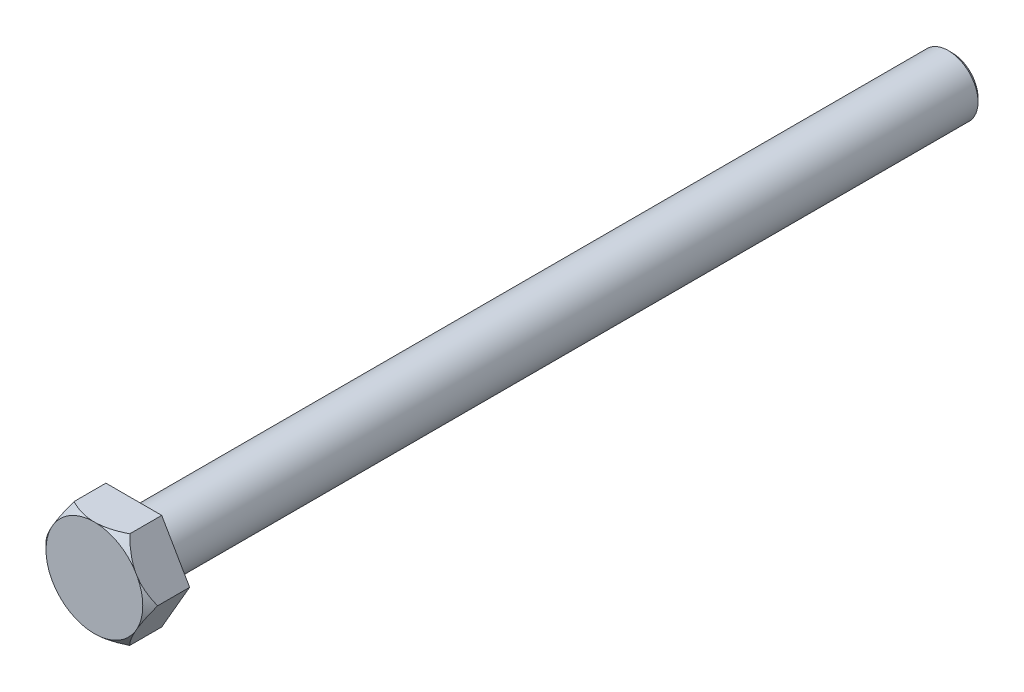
from build123d import *

# Parameters (mm, degrees)
BOSS_EXTRU_1_DEPTH = 5.3


with BuildPart() as part:
    # Esquisse1 → Boss.-Extru.1 (new body)
    with BuildSketch(Plane.XY):
        Polygon((7.505553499, 0), (3.75277675, 6.5), (-3.75277675, 6.5), (-7.505553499, 0), (-3.75277675, -6.5), (3.75277675, -6.5), align=None)
    extrude(amount=BOSS_EXTRU_1_DEPTH)

    # Esquisse3 → Enl_vement de mati_re-R_volution2 (revolve, cut)
    with BuildSketch(Plane(origin=(0, 0, 0), x_dir=(1, 0, 0), z_dir=(0, 1, 0))):
        Polygon((-7.505553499, -4.3), (-6.505553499, -5.3), (-6.505553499, -6.142860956), (-9.024896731, -6.142860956), (-9.024896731, -4.3), align=None)
    revolve(axis=Axis((0, 0, -2.903094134), (0, 0, 1)), mode=Mode.SUBTRACT)


with BuildPart() as body_2:
    # Esquisse4 → R_volution2 (revolve)
    with BuildSketch(Plane(origin=(0, 0, 0), x_dir=(0, 0, -1), z_dir=(1, 0, 0)), mode=Mode.PRIVATE) as r_volution2_sk:
        Polygon((0, -4), (109.5, -4), (110, -3.5), (110, 0), (0, 0), align=None)
    revolve(r_volution2_sk.sketch.rotate(Axis((0, 0, 0), (0, 0, -1)), 270), axis=Axis((0, 0, 0), (0, 0, -1)))


solid = Compound([part.part, body_2.part])
